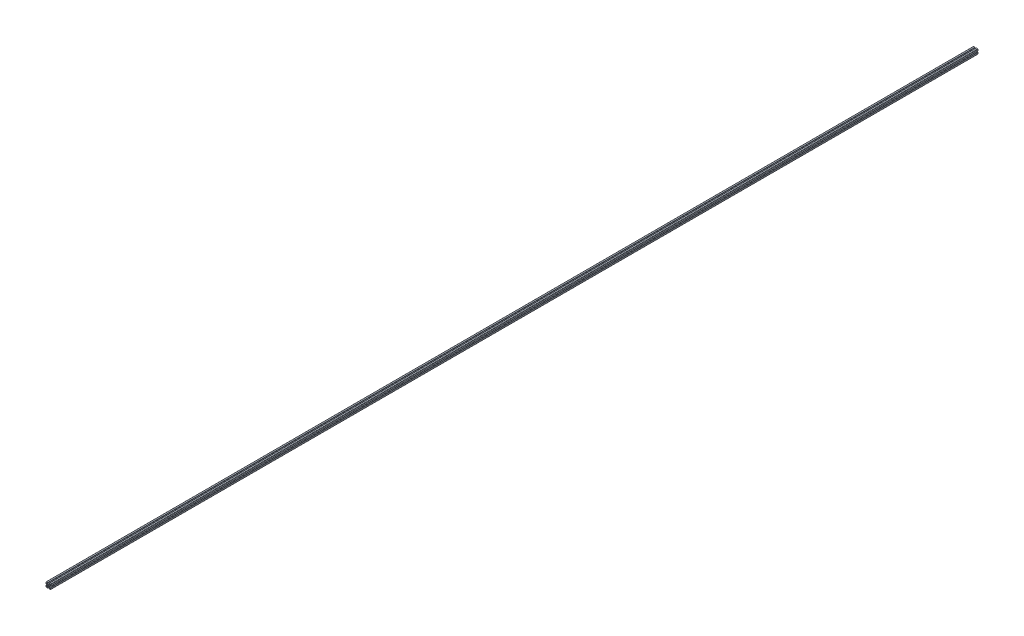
from build123d import *

# Parameters (mm, degrees)
EXTRUDE1_DEPTH = 4000


with BuildPart() as part:
    # Sketch1 → Extrude1 (new body)
    with BuildSketch(Plane.XY):
        with BuildLine():
            Line((-5.032287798, -0.341059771), (-5.516287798, -0.341059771))
            ThreePointArc((-5.516287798, -0.341059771), (-5.875498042, -0.192270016), (-6.024287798, 0.166940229))
            Line((-6.024287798, 0.166940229), (-6.024287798, 2.515940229))
            ThreePointArc((-6.024287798, 2.515940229), (-6.173077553, 2.875150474), (-6.532287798, 3.023940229))
            Line((-6.532287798, 3.023940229), (-7.258207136, 3.023940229))
            ThreePointArc((-7.258207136, 3.023940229), (-7.45261032, 2.985271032), (-7.617417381, 2.875150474))
            Line((-7.617417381, 2.875150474), (-10.720498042, -0.227930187))
            ThreePointArc((-10.720498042, -0.227930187), (-10.8306186, -0.392737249), (-10.869287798, -0.587140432))
            Line((-10.869287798, -0.587140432), (-10.869287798, -5.354979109))
            ThreePointArc((-10.869287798, -5.354979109), (-10.8306186, -5.549382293), (-10.720498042, -5.714189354))
            Line((-10.720498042, -5.714189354), (-7.617417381, -8.817270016))
            ThreePointArc((-7.617417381, -8.817270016), (-7.45261032, -8.927390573), (-7.258207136, -8.966059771))
            Line((-7.258207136, -8.966059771), (-6.532287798, -8.966059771))
            ThreePointArc((-6.532287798, -8.966059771), (-6.173077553, -8.817270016), (-6.024287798, -8.458059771))
            Line((-6.024287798, -8.458059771), (-6.024287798, -6.109059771))
            ThreePointArc((-6.024287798, -6.109059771), (-5.875498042, -5.749849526), (-5.516287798, -5.601059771))
            Line((-5.516287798, -5.601059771), (-5.032287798, -5.601059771))
            ThreePointArc((-5.032287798, -5.601059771), (-4.673077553, -5.749849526), (-4.524287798, -6.109059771))
            Line((-4.524287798, -6.109059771), (-4.524287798, -11.471059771))
            ThreePointArc((-4.524287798, -11.471059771), (-4.963627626, -12.531719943), (-6.024287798, -12.971059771))
            Line((-6.024287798, -12.971059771), (-11.386287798, -12.971059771))
            ThreePointArc((-11.386287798, -12.971059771), (-11.745498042, -12.822270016), (-11.894287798, -12.463059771))
            Line((-11.894287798, -12.463059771), (-11.894287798, -11.979059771))
            ThreePointArc((-11.894287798, -11.979059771), (-11.745498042, -11.619849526), (-11.386287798, -11.471059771))
            Line((-11.386287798, -11.471059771), (-9.037287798, -11.471059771))
            ThreePointArc((-9.037287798, -11.471059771), (-8.678077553, -11.322270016), (-8.529287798, -10.963059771))
            Line((-8.529287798, -10.963059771), (-8.529287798, -10.237140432))
            ThreePointArc((-8.529287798, -10.237140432), (-8.567956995, -10.042737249), (-8.678077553, -9.877930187))
            Line((-8.678077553, -9.877930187), (-11.781158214, -6.774849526))
            ThreePointArc((-11.781158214, -6.774849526), (-11.945965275, -6.664728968), (-12.140368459, -6.626059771))
            Line((-12.140368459, -6.626059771), (-16.908207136, -6.626059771))
            ThreePointArc((-16.908207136, -6.626059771), (-17.10261032, -6.664728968), (-17.267417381, -6.774849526))
            Line((-17.267417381, -6.774849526), (-20.370498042, -9.877930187))
            ThreePointArc((-20.370498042, -9.877930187), (-20.4806186, -10.042737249), (-20.519287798, -10.237140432))
            Line((-20.519287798, -10.237140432), (-20.519287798, -10.963059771))
            ThreePointArc((-20.519287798, -10.963059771), (-20.370498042, -11.322270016), (-20.011287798, -11.471059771))
            Line((-20.011287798, -11.471059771), (-17.662287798, -11.471059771))
            ThreePointArc((-17.662287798, -11.471059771), (-17.303077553, -11.619849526), (-17.154287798, -11.979059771))
            Line((-17.154287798, -11.979059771), (-17.154287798, -12.463059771))
            ThreePointArc((-17.154287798, -12.463059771), (-17.303077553, -12.822270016), (-17.662287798, -12.971059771))
            Line((-17.662287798, -12.971059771), (-23.024287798, -12.971059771))
            ThreePointArc((-23.024287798, -12.971059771), (-24.084947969, -12.531719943), (-24.524287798, -11.471059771))
            Line((-24.524287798, -11.471059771), (-24.524287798, -6.109059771))
            ThreePointArc((-24.524287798, -6.109059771), (-24.375498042, -5.749849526), (-24.016287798, -5.601059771))
            Line((-24.016287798, -5.601059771), (-23.532287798, -5.601059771))
            ThreePointArc((-23.532287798, -5.601059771), (-23.173077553, -5.749849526), (-23.024287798, -6.109059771))
            Line((-23.024287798, -6.109059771), (-23.024287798, -8.458059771))
            ThreePointArc((-23.024287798, -8.458059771), (-22.875498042, -8.817270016), (-22.516287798, -8.966059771))
            Line((-22.516287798, -8.966059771), (-21.790368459, -8.966059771))
            ThreePointArc((-21.790368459, -8.966059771), (-21.595965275, -8.927390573), (-21.431158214, -8.817270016))
            Line((-21.431158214, -8.817270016), (-18.328077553, -5.714189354))
            ThreePointArc((-18.328077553, -5.714189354), (-18.217956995, -5.549382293), (-18.179287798, -5.354979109))
            Line((-18.179287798, -5.354979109), (-18.179287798, -0.587140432))
            ThreePointArc((-18.179287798, -0.587140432), (-18.217956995, -0.392737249), (-18.328077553, -0.227930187))
            Line((-18.328077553, -0.227930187), (-21.431158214, 2.875150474))
            ThreePointArc((-21.431158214, 2.875150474), (-21.595965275, 2.985271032), (-21.790368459, 3.023940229))
            Line((-21.790368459, 3.023940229), (-22.516287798, 3.023940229))
            ThreePointArc((-22.516287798, 3.023940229), (-22.875498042, 2.875150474), (-23.024287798, 2.515940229))
            Line((-23.024287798, 2.515940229), (-23.024287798, 0.166940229))
            ThreePointArc((-23.024287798, 0.166940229), (-23.173077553, -0.192270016), (-23.532287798, -0.341059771))
            Line((-23.532287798, -0.341059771), (-24.016287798, -0.341059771))
            ThreePointArc((-24.016287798, -0.341059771), (-24.375498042, -0.192270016), (-24.524287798, 0.166940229))
            Line((-24.524287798, 0.166940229), (-24.524287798, 5.528940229))
            ThreePointArc((-24.524287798, 5.528940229), (-24.084947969, 6.589600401), (-23.024287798, 7.028940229))
            Line((-23.024287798, 7.028940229), (-17.662287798, 7.028940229))
            ThreePointArc((-17.662287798, 7.028940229), (-17.303077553, 6.880150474), (-17.154287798, 6.520940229))
            Line((-17.154287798, 6.520940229), (-17.154287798, 6.036940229))
            ThreePointArc((-17.154287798, 6.036940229), (-17.303077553, 5.677729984), (-17.662287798, 5.528940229))
            Line((-17.662287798, 5.528940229), (-20.011287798, 5.528940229))
            ThreePointArc((-20.011287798, 5.528940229), (-20.370498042, 5.380150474), (-20.519287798, 5.020940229))
            Line((-20.519287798, 5.020940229), (-20.519287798, 4.295020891))
            ThreePointArc((-20.519287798, 4.295020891), (-20.4806186, 4.100617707), (-20.370498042, 3.935810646))
            Line((-20.370498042, 3.935810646), (-17.267417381, 0.832729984))
            ThreePointArc((-17.267417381, 0.832729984), (-17.10261032, 0.722609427), (-16.908207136, 0.683940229))
            Line((-16.908207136, 0.683940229), (-12.140368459, 0.683940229))
            ThreePointArc((-12.140368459, 0.683940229), (-11.945965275, 0.722609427), (-11.781158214, 0.832729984))
            Line((-11.781158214, 0.832729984), (-8.678077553, 3.935810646))
            ThreePointArc((-8.678077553, 3.935810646), (-8.567956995, 4.100617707), (-8.529287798, 4.295020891))
            Line((-8.529287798, 4.295020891), (-8.529287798, 5.020940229))
            ThreePointArc((-8.529287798, 5.020940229), (-8.678077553, 5.380150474), (-9.037287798, 5.528940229))
            Line((-9.037287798, 5.528940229), (-11.386287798, 5.528940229))
            ThreePointArc((-11.386287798, 5.528940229), (-11.745498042, 5.677729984), (-11.894287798, 6.036940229))
            Line((-11.894287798, 6.036940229), (-11.894287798, 6.520940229))
            ThreePointArc((-11.894287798, 6.520940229), (-11.745498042, 6.880150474), (-11.386287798, 7.028940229))
            Line((-11.386287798, 7.028940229), (-6.024287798, 7.028940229))
            ThreePointArc((-6.024287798, 7.028940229), (-4.963627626, 6.589600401), (-4.524287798, 5.528940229))
            Line((-4.524287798, 5.528940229), (-4.524287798, 0.166940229))
            ThreePointArc((-4.524287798, 0.166940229), (-4.673077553, -0.192270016), (-5.032287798, -0.341059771))
        make_face()
        with BuildLine():
            Line((-12.399386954, -5.275565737), (-12.219781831, -5.095960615))
            ThreePointArc((-12.219781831, -5.095960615), (-12.018349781, -4.327527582), (-12.589154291, -3.775036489))
            ThreePointArc((-12.589154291, -3.775036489), (-12.428787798, -2.971059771), (-12.589154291, -2.167083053))
            ThreePointArc((-12.589154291, -2.167083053), (-12.018349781, -1.61459196), (-12.219781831, -0.846158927))
            Line((-12.219781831, -0.846158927), (-12.399386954, -0.666553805))
            ThreePointArc((-12.399386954, -0.666553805), (-13.167819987, -0.465121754), (-13.72031108, -1.035926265))
            ThreePointArc((-13.72031108, -1.035926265), (-14.524287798, -0.875559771), (-15.328264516, -1.035926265))
            ThreePointArc((-15.328264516, -1.035926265), (-15.880755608, -0.465121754), (-16.649188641, -0.666553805))
            Line((-16.649188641, -0.666553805), (-16.828793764, -0.846158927))
            ThreePointArc((-16.828793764, -0.846158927), (-17.030225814, -1.61459196), (-16.459421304, -2.167083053))
            ThreePointArc((-16.459421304, -2.167083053), (-16.619787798, -2.971059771), (-16.459421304, -3.775036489))
            ThreePointArc((-16.459421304, -3.775036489), (-17.030225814, -4.327527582), (-16.828793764, -5.095960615))
            Line((-16.828793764, -5.095960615), (-16.649188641, -5.275565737))
            ThreePointArc((-16.649188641, -5.275565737), (-15.880755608, -5.476997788), (-15.328264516, -4.906193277))
            ThreePointArc((-15.328264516, -4.906193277), (-14.524287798, -5.066559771), (-13.72031108, -4.906193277))
            ThreePointArc((-13.72031108, -4.906193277), (-13.167819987, -5.476997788), (-12.399386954, -5.275565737))
        make_face(mode=Mode.SUBTRACT)
    extrude(amount=EXTRUDE1_DEPTH)


solid = part.part
